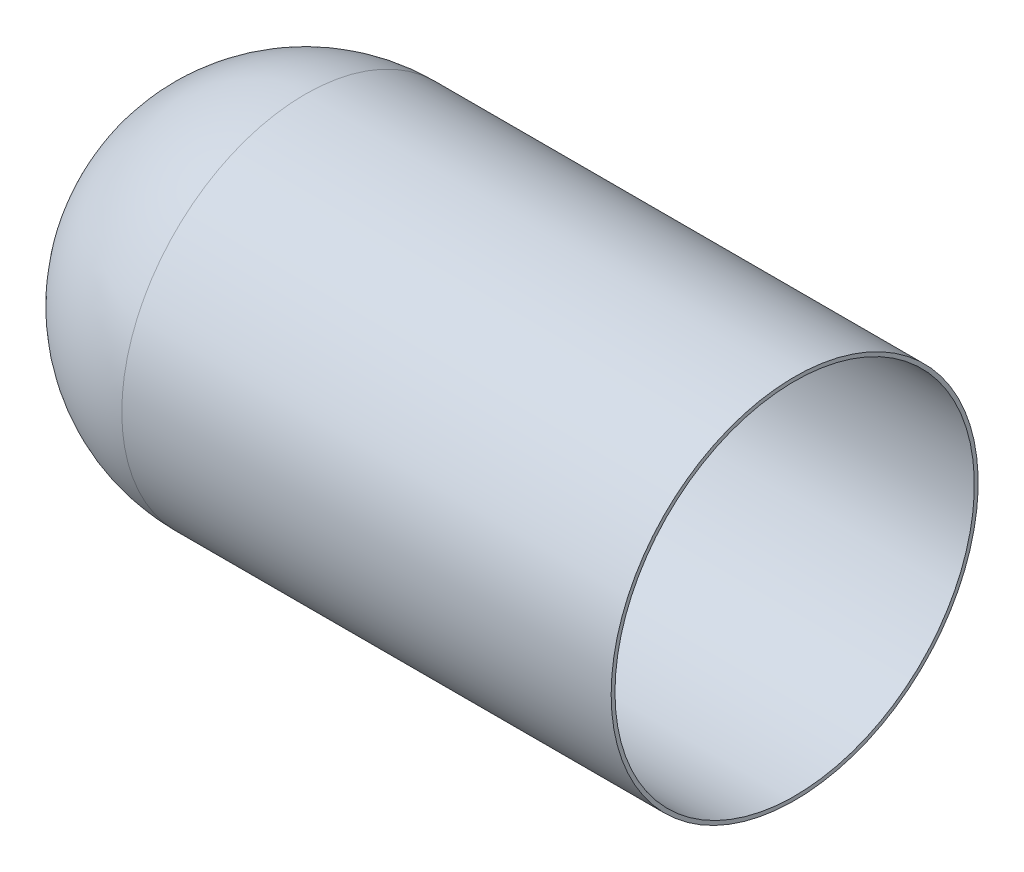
ISO-10303-21;
HEADER;
FILE_DESCRIPTION(('STEP AP214'),'2;1');
FILE_NAME('part.step','',(''),(''),'','','');
FILE_SCHEMA(('AUTOMOTIVE_DESIGN { 1 0 10303 214 1 1 1 1 }'));
ENDSEC;
DATA;
#1=APPLICATION_CONTEXT('core data for automotive mechanical design processes');
#2=APPLICATION_PROTOCOL_DEFINITION('international standard','automotive_design',2000,#1);
#3=PRODUCT_CONTEXT('',#1,'mechanical');
#4=PRODUCT('Part','Part','',(#3));
#5=PRODUCT_RELATED_PRODUCT_CATEGORY('part','',(#4));
#6=PRODUCT_DEFINITION_FORMATION('','',#4);
#7=PRODUCT_DEFINITION_CONTEXT('part definition',#1,'design');
#8=PRODUCT_DEFINITION('design','',#6,#7);
#9=PRODUCT_DEFINITION_SHAPE('','',#8);
#10=(LENGTH_UNIT() NAMED_UNIT(*) SI_UNIT(.MILLI.,.METRE.));
#11=(NAMED_UNIT(*) PLANE_ANGLE_UNIT() SI_UNIT($,.RADIAN.));
#12=(NAMED_UNIT(*) SI_UNIT($,.STERADIAN.) SOLID_ANGLE_UNIT());
#13=UNCERTAINTY_MEASURE_WITH_UNIT(LENGTH_MEASURE(1.E-05),#10,'distance_accuracy_value','');
#14=(GEOMETRIC_REPRESENTATION_CONTEXT(3) GLOBAL_UNCERTAINTY_ASSIGNED_CONTEXT((#13)) GLOBAL_UNIT_ASSIGNED_CONTEXT((#10,
#11,#12)) REPRESENTATION_CONTEXT('',''));
#15=CARTESIAN_POINT('',(0.,0.,0.));
#16=DIRECTION('',(0.,0.,1.));
#17=DIRECTION('',(1.,0.,0.));
#18=AXIS2_PLACEMENT_3D('',#15,#16,#17);
#19=CARTESIAN_POINT('',(0.,152.4,0.));
#20=DIRECTION('',(-1.,0.,0.));
#21=DIRECTION('',(0.,0.,1.));
#22=AXIS2_PLACEMENT_3D('',#19,#20,#21);
#23=PLANE('',#22);
#24=CARTESIAN_POINT('',(0.,0.,0.));
#25=DIRECTION('',(-1.,0.,0.));
#26=DIRECTION('',(0.,0.,1.));
#27=AXIS2_PLACEMENT_3D('',#24,#25,#26);
#28=CIRCLE('',#27,152.4);
#29=CARTESIAN_POINT('',(0.,0.,152.4));
#30=VERTEX_POINT('',#29);
#31=EDGE_CURVE('E10',#30,#30,#28,.T.);
#32=ORIENTED_EDGE('',*,*,#31,.F.);
#33=EDGE_LOOP('',(#32));
#34=FACE_BOUND('',#33,.T.);
#35=CARTESIAN_POINT('',(0.,0.,0.));
#36=DIRECTION('',(-1.,0.,0.));
#37=DIRECTION('',(0.,0.,1.));
#38=AXIS2_PLACEMENT_3D('',#35,#36,#37);
#39=CIRCLE('',#38,149.225);
#40=CARTESIAN_POINT('',(0.,0.,149.225));
#41=VERTEX_POINT('',#40);
#42=EDGE_CURVE('E48',#41,#41,#39,.T.);
#43=ORIENTED_EDGE('',*,*,#42,.T.);
#44=EDGE_LOOP('',(#43));
#45=FACE_BOUND('',#44,.T.);
#46=ADVANCED_FACE('F34',(#34,#45),#23,.F.);
#47=CARTESIAN_POINT('',(0.,0.,0.));
#48=DIRECTION('',(-1.,0.,0.));
#49=DIRECTION('',(0.,0.,1.));
#50=AXIS2_PLACEMENT_3D('',#47,#48,#49);
#51=CYLINDRICAL_SURFACE('',#50,152.4);
#52=CARTESIAN_POINT('',(-406.399999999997,0.,0.));
#53=DIRECTION('',(-1.,0.,0.));
#54=DIRECTION('',(0.,0.,1.));
#55=AXIS2_PLACEMENT_3D('',#52,#53,#54);
#56=CIRCLE('',#55,152.4);
#57=CARTESIAN_POINT('',(-406.399999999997,0.,152.4));
#58=VERTEX_POINT('',#57);
#59=EDGE_CURVE('E40',#58,#58,#56,.T.);
#60=ORIENTED_EDGE('',*,*,#59,.F.);
#61=EDGE_LOOP('',(#60));
#62=FACE_BOUND('',#61,.T.);
#63=ORIENTED_EDGE('',*,*,#31,.T.);
#64=EDGE_LOOP('',(#63));
#65=FACE_BOUND('',#64,.T.);
#66=ADVANCED_FACE('F76',(#62,#65),#51,.T.);
#67=CARTESIAN_POINT('',(-406.399999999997,0.,0.));
#68=DIRECTION('',(-1.,0.,0.));
#69=DIRECTION('',(0.,1.,0.));
#70=AXIS2_PLACEMENT_3D('',#67,#68,#69);
#71=SPHERICAL_SURFACE('',#70,152.4);
#72=ORIENTED_EDGE('',*,*,#59,.T.);
#73=EDGE_LOOP('',(#72));
#74=FACE_BOUND('',#73,.T.);
#75=ADVANCED_FACE('F63',(#74),#71,.T.);
#76=CARTESIAN_POINT('',(-406.399999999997,0.,0.));
#77=DIRECTION('',(-1.,0.,0.));
#78=DIRECTION('',(0.,1.,0.));
#79=AXIS2_PLACEMENT_3D('',#76,#77,#78);
#80=SPHERICAL_SURFACE('',#79,149.225);
#81=CARTESIAN_POINT('',(-546.099999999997,0.,0.));
#82=DIRECTION('',(1.,0.,0.));
#83=DIRECTION('',(0.,1.,0.));
#84=AXIS2_PLACEMENT_3D('',#81,#82,#83);
#85=CIRCLE('',#84,52.4596094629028);
#86=CARTESIAN_POINT('',(-546.099999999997,52.4596094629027,0.));
#87=VERTEX_POINT('',#86);
#88=EDGE_CURVE('E53',#87,#87,#85,.T.);
#89=ORIENTED_EDGE('',*,*,#88,.F.);
#90=EDGE_LOOP('',(#89));
#91=FACE_BOUND('',#90,.T.);
#92=CARTESIAN_POINT('',(-406.399999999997,0.,0.));
#93=DIRECTION('',(-1.,0.,0.));
#94=DIRECTION('',(0.,0.,1.));
#95=AXIS2_PLACEMENT_3D('',#92,#93,#94);
#96=CIRCLE('',#95,149.225);
#97=CARTESIAN_POINT('',(-406.399999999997,0.,149.225));
#98=VERTEX_POINT('',#97);
#99=EDGE_CURVE('E44',#98,#98,#96,.T.);
#100=ORIENTED_EDGE('',*,*,#99,.F.);
#101=EDGE_LOOP('',(#100));
#102=FACE_BOUND('',#101,.T.);
#103=ADVANCED_FACE('F59',(#91,#102),#80,.F.);
#104=CARTESIAN_POINT('',(0.,0.,0.));
#105=DIRECTION('',(-1.,0.,0.));
#106=DIRECTION('',(0.,0.,1.));
#107=AXIS2_PLACEMENT_3D('',#104,#105,#106);
#108=CYLINDRICAL_SURFACE('',#107,149.225);
#109=ORIENTED_EDGE('',*,*,#42,.F.);
#110=EDGE_LOOP('',(#109));
#111=FACE_BOUND('',#110,.T.);
#112=ORIENTED_EDGE('',*,*,#99,.T.);
#113=EDGE_LOOP('',(#112));
#114=FACE_BOUND('',#113,.T.);
#115=ADVANCED_FACE('F62',(#111,#114),#108,.F.);
#116=CARTESIAN_POINT('',(-546.099999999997,52.4596094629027,0.));
#117=DIRECTION('',(1.,0.,0.));
#118=DIRECTION('',(0.,1.,0.));
#119=AXIS2_PLACEMENT_3D('',#116,#117,#118);
#120=PLANE('',#119);
#121=ORIENTED_EDGE('',*,*,#88,.T.);
#122=EDGE_LOOP('',(#121));
#123=FACE_BOUND('',#122,.T.);
#124=ADVANCED_FACE('F57',(#123),#120,.T.);
#125=CLOSED_SHELL('',(#46,#66,#75,#103,#115,#124));
#126=MANIFOLD_SOLID_BREP('B2',#125);
#127=ADVANCED_BREP_SHAPE_REPRESENTATION('',(#18,#126),#14);
#128=SHAPE_DEFINITION_REPRESENTATION(#9,#127);
ENDSEC;
END-ISO-10303-21;
